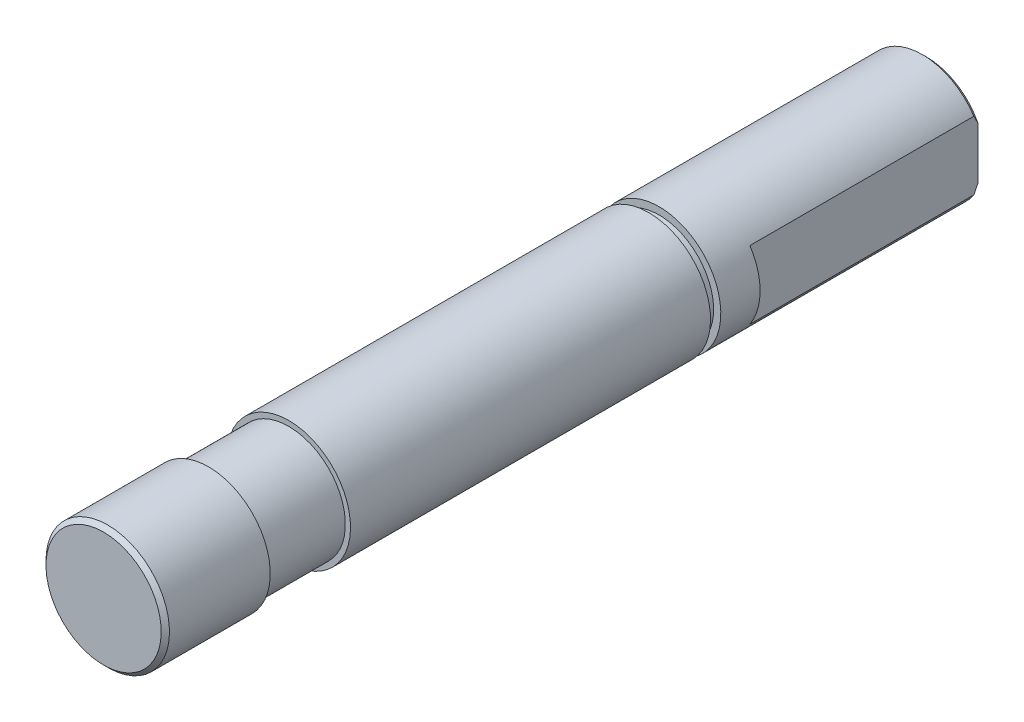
ISO-10303-21;
HEADER;
FILE_DESCRIPTION(('STEP AP214'),'2;1');
FILE_NAME('part.step','',(''),(''),'','','');
FILE_SCHEMA(('AUTOMOTIVE_DESIGN { 1 0 10303 214 1 1 1 1 }'));
ENDSEC;
DATA;
#1=APPLICATION_CONTEXT('core data for automotive mechanical design processes');
#2=APPLICATION_PROTOCOL_DEFINITION('international standard','automotive_design',2000,#1);
#3=PRODUCT_CONTEXT('',#1,'mechanical');
#4=PRODUCT('Part','Part','',(#3));
#5=PRODUCT_RELATED_PRODUCT_CATEGORY('part','',(#4));
#6=PRODUCT_DEFINITION_FORMATION('','',#4);
#7=PRODUCT_DEFINITION_CONTEXT('part definition',#1,'design');
#8=PRODUCT_DEFINITION('design','',#6,#7);
#9=PRODUCT_DEFINITION_SHAPE('','',#8);
#10=(LENGTH_UNIT() NAMED_UNIT(*) SI_UNIT(.MILLI.,.METRE.));
#11=(NAMED_UNIT(*) PLANE_ANGLE_UNIT() SI_UNIT($,.RADIAN.));
#12=(NAMED_UNIT(*) SI_UNIT($,.STERADIAN.) SOLID_ANGLE_UNIT());
#13=UNCERTAINTY_MEASURE_WITH_UNIT(LENGTH_MEASURE(1.E-05),#10,'distance_accuracy_value','');
#14=(GEOMETRIC_REPRESENTATION_CONTEXT(3) GLOBAL_UNCERTAINTY_ASSIGNED_CONTEXT((#13)) GLOBAL_UNIT_ASSIGNED_CONTEXT((#10,
#11,#12)) REPRESENTATION_CONTEXT('',''));
#15=CARTESIAN_POINT('',(0.,0.,0.));
#16=DIRECTION('',(0.,0.,1.));
#17=DIRECTION('',(1.,0.,0.));
#18=AXIS2_PLACEMENT_3D('',#15,#16,#17);
#19=CARTESIAN_POINT('',(-2.8336,-2.8336,40.));
#20=DIRECTION('',(0.,0.,1.));
#21=DIRECTION('',(1.,0.,0.));
#22=AXIS2_PLACEMENT_3D('',#19,#20,#21);
#23=PLANE('',#22);
#24=CARTESIAN_POINT('',(0.,0.,39.9999999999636));
#25=DIRECTION('',(0.,0.,-1.));
#26=DIRECTION('',(0.,1.,0.));
#27=AXIS2_PLACEMENT_3D('',#24,#25,#26);
#28=CIRCLE('',#27,2.79999999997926);
#29=CARTESIAN_POINT('',(0.,2.79999999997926,39.9999999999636));
#30=VERTEX_POINT('',#29);
#31=EDGE_CURVE('E20',#30,#30,#28,.T.);
#32=ORIENTED_EDGE('',*,*,#31,.F.);
#33=EDGE_LOOP('',(#32));
#34=FACE_BOUND('',#33,.T.);
#35=ADVANCED_FACE('F17',(#34),#23,.T.);
#36=CARTESIAN_POINT('',(-2.83180812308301,2.84325311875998,0.));
#37=DIRECTION('',(0.,0.,-1.));
#38=DIRECTION('',(-1.,0.,0.));
#39=AXIS2_PLACEMENT_3D('',#36,#37,#38);
#40=PLANE('',#39);
#41=CARTESIAN_POINT('',(0.,0.,0.));
#42=DIRECTION('',(0.,0.,1.));
#43=DIRECTION('',(1.,0.,0.));
#44=AXIS2_PLACEMENT_3D('',#41,#42,#43);
#45=CIRCLE('',#44,2.79999999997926);
#46=CARTESIAN_POINT('',(2.50135384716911,1.25826425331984,8.28163234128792E-12));
#47=VERTEX_POINT('',#46);
#48=CARTESIAN_POINT('',(2.50135384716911,-1.25826425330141,0.));
#49=VERTEX_POINT('',#48);
#50=EDGE_CURVE('E48',#47,#49,#45,.T.);
#51=ORIENTED_EDGE('',*,*,#50,.F.);
#52=DIRECTION('',(0.,1.,0.));
#53=VECTOR('',#52,1.);
#54=CARTESIAN_POINT('',(2.50135384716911,-1.6562695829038,0.));
#55=LINE('',#54,#53);
#56=EDGE_CURVE('E51',#49,#47,#55,.T.);
#57=ORIENTED_EDGE('',*,*,#56,.F.);
#58=EDGE_LOOP('',(#51,#57));
#59=FACE_BOUND('',#58,.T.);
#60=ADVANCED_FACE('F52',(#59),#40,.T.);
#61=CARTESIAN_POINT('',(0.,0.,39.8000000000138));
#62=DIRECTION('',(0.,0.,-1.));
#63=DIRECTION('',(0.,1.,0.));
#64=AXIS2_PLACEMENT_3D('',#61,#62,#63);
#65=CONICAL_SURFACE('',#64,2.99999999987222,0.785398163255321);
#66=ORIENTED_EDGE('',*,*,#31,.T.);
#67=EDGE_LOOP('',(#66));
#68=FACE_BOUND('',#67,.T.);
#69=CARTESIAN_POINT('',(0.,0.,39.8));
#70=DIRECTION('',(0.,0.,-1.));
#71=DIRECTION('',(-1.,0.,0.));
#72=AXIS2_PLACEMENT_3D('',#69,#70,#71);
#73=CIRCLE('',#72,3.);
#74=CARTESIAN_POINT('',(-3.,0.,39.8));
#75=VERTEX_POINT('',#74);
#76=EDGE_CURVE('E66',#75,#75,#73,.T.);
#77=ORIENTED_EDGE('',*,*,#76,.F.);
#78=EDGE_LOOP('',(#77));
#79=FACE_BOUND('',#78,.T.);
#80=ADVANCED_FACE('F91',(#68,#79),#65,.T.);
#81=CARTESIAN_POINT('',(0.,0.,0.200000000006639));
#82=DIRECTION('',(0.,0.,1.));
#83=DIRECTION('',(1.,0.,0.));
#84=AXIS2_PLACEMENT_3D('',#81,#82,#83);
#85=CONICAL_SURFACE('',#84,2.9999999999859,0.785398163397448);
#86=CARTESIAN_POINT('',(2.50135384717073,1.25826425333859,1.58616922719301E-11));
#87=CARTESIAN_POINT('',(2.5013538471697,1.29213988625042,0.0152238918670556));
#88=CARTESIAN_POINT('',(2.50135384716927,1.3258312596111,0.0308538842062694));
#89=CARTESIAN_POINT('',(2.50135384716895,1.39284470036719,0.0628516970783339));
#90=CARTESIAN_POINT('',(2.50135384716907,1.42616691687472,0.0792192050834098));
#91=CARTESIAN_POINT('',(2.50135384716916,1.4924681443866,0.112629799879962));
#92=CARTESIAN_POINT('',(2.50135384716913,1.52544717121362,0.129672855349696));
#93=CARTESIAN_POINT('',(2.50135384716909,1.59109264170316,0.16438386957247));
#94=CARTESIAN_POINT('',(2.50135384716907,1.62375894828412,0.182052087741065));
#95=CARTESIAN_POINT('',(2.50135384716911,1.6562695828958,0.200000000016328));
#96=B_SPLINE_CURVE_WITH_KNOTS('',3,(#86,#87,#88,#89,#90,#91,#92,#93,#94,#95),.UNSPECIFIED.,.F.,
.F.,(4,2,2,2,4),(0.,0.11141283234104,0.222778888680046,0.334139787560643,0.445547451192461),.UNSPECIFIED.);
#97=CARTESIAN_POINT('',(2.50135384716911,1.65626958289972,0.200000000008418));
#98=VERTEX_POINT('',#97);
#99=EDGE_CURVE('E56',#47,#98,#96,.T.);
#100=ORIENTED_EDGE('',*,*,#99,.F.);
#101=ORIENTED_EDGE('',*,*,#50,.T.);
#102=CARTESIAN_POINT('',(2.50135384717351,-1.65626958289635,0.200000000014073));
#103=CARTESIAN_POINT('',(2.5013538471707,-1.62375894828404,0.182052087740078));
#104=CARTESIAN_POINT('',(2.50135384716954,-1.59109264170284,0.164383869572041));
#105=CARTESIAN_POINT('',(2.50135384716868,-1.52544717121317,0.129672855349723));
#106=CARTESIAN_POINT('',(2.50135384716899,-1.49246814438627,0.112629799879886));
#107=CARTESIAN_POINT('',(2.50135384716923,-1.42616691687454,0.0792192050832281));
#108=CARTESIAN_POINT('',(2.50135384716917,-1.39284470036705,0.0628516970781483));
#109=CARTESIAN_POINT('',(2.50135384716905,-1.32583125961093,0.030853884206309));
#110=CARTESIAN_POINT('',(2.50135384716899,-1.29213988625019,0.0152238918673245));
#111=CARTESIAN_POINT('',(2.50135384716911,-1.25826425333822,1.65385804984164E-11));
#112=B_SPLINE_CURVE_WITH_KNOTS('',3,(#102,#103,#104,#105,#106,#107,#108,#109,#110,#111),
.UNSPECIFIED.,.F.,.F.,(4,2,2,2,4),(0.,0.111407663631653,0.2227685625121,0.334134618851,
0.445547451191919),.UNSPECIFIED.);
#113=CARTESIAN_POINT('',(2.50135384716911,-1.65626958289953,0.200000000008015));
#114=VERTEX_POINT('',#113);
#115=EDGE_CURVE('E60',#114,#49,#112,.T.);
#116=ORIENTED_EDGE('',*,*,#115,.F.);
#117=CARTESIAN_POINT('',(0.,0.,0.199999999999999));
#118=DIRECTION('',(0.,0.,1.));
#119=DIRECTION('',(0.,-1.,0.));
#120=AXIS2_PLACEMENT_3D('',#117,#118,#119);
#121=CIRCLE('',#120,3.);
#122=EDGE_CURVE('E69',#98,#114,#121,.T.);
#123=ORIENTED_EDGE('',*,*,#122,.F.);
#124=EDGE_LOOP('',(#100,#101,#116,#123));
#125=FACE_BOUND('',#124,.T.);
#126=ADVANCED_FACE('F59',(#125),#85,.T.);
#127=CARTESIAN_POINT('',(3.00299187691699,-1.67614481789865,11.0896717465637));
#128=DIRECTION('',(0.,0.,-1.));
#129=DIRECTION('',(-1.,0.,0.));
#130=AXIS2_PLACEMENT_3D('',#127,#128,#129);
#131=PLANE('',#130);
#132=CARTESIAN_POINT('',(0.,0.,11.0896717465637));
#133=DIRECTION('',(0.,0.,1.));
#134=DIRECTION('',(0.,-1.,0.));
#135=AXIS2_PLACEMENT_3D('',#132,#133,#134);
#136=CIRCLE('',#135,3.);
#137=CARTESIAN_POINT('',(2.50135384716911,-1.65626958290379,11.0896717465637));
#138=VERTEX_POINT('',#137);
#139=CARTESIAN_POINT('',(2.50135384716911,1.65626958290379,11.0896717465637));
#140=VERTEX_POINT('',#139);
#141=EDGE_CURVE('E79',#138,#140,#136,.T.);
#142=ORIENTED_EDGE('',*,*,#141,.F.);
#143=DIRECTION('',(0.,1.,0.));
#144=VECTOR('',#143,1.);
#145=CARTESIAN_POINT('',(2.50135384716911,-1.6562695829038,11.0896717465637));
#146=LINE('',#145,#144);
#147=EDGE_CURVE('E34',#140,#138,#146,.F.);
#148=ORIENTED_EDGE('',*,*,#147,.F.);
#149=EDGE_LOOP('',(#142,#148));
#150=FACE_BOUND('',#149,.T.);
#151=ADVANCED_FACE('F90',(#150),#131,.T.);
#152=CARTESIAN_POINT('',(2.50135384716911,-1.6562695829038,11.0896717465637));
#153=DIRECTION('',(1.,0.,0.));
#154=DIRECTION('',(0.,0.,-1.));
#155=AXIS2_PLACEMENT_3D('',#152,#153,#154);
#156=PLANE('',#155);
#157=DIRECTION('',(0.,0.,1.));
#158=VECTOR('',#157,1.);
#159=CARTESIAN_POINT('',(2.50135384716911,-1.65626958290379,13.));
#160=LINE('',#159,#158);
#161=EDGE_CURVE('E64',#114,#138,#160,.T.);
#162=ORIENTED_EDGE('',*,*,#161,.F.);
#163=ORIENTED_EDGE('',*,*,#115,.T.);
#164=ORIENTED_EDGE('',*,*,#56,.T.);
#165=ORIENTED_EDGE('',*,*,#99,.T.);
#166=DIRECTION('',(0.,0.,1.));
#167=VECTOR('',#166,1.);
#168=CARTESIAN_POINT('',(2.50135384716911,1.65626958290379,13.));
#169=LINE('',#168,#167);
#170=EDGE_CURVE('E148',#140,#98,#169,.F.);
#171=ORIENTED_EDGE('',*,*,#170,.F.);
#172=ORIENTED_EDGE('',*,*,#147,.T.);
#173=EDGE_LOOP('',(#162,#163,#164,#165,#171,#172));
#174=FACE_BOUND('',#173,.T.);
#175=ADVANCED_FACE('F62',(#174),#156,.T.);
#176=CARTESIAN_POINT('',(0.,0.,34.9));
#177=DIRECTION('',(0.,0.,-1.));
#178=DIRECTION('',(-1.,0.,0.));
#179=AXIS2_PLACEMENT_3D('',#176,#177,#178);
#180=CYLINDRICAL_SURFACE('',#179,3.);
#181=ORIENTED_EDGE('',*,*,#76,.T.);
#182=EDGE_LOOP('',(#181));
#183=FACE_BOUND('',#182,.T.);
#184=CARTESIAN_POINT('',(0.,0.,34.9));
#185=DIRECTION('',(0.,0.,-1.));
#186=DIRECTION('',(-1.,0.,0.));
#187=AXIS2_PLACEMENT_3D('',#184,#185,#186);
#188=CIRCLE('',#187,3.);
#189=CARTESIAN_POINT('',(-3.,0.,34.9));
#190=VERTEX_POINT('',#189);
#191=EDGE_CURVE('E146',#190,#190,#188,.T.);
#192=ORIENTED_EDGE('',*,*,#191,.F.);
#193=EDGE_LOOP('',(#192));
#194=FACE_BOUND('',#193,.T.);
#195=ADVANCED_FACE('F135',(#183,#194),#180,.T.);
#196=CARTESIAN_POINT('',(0.,0.,13.));
#197=DIRECTION('',(0.,0.,1.));
#198=DIRECTION('',(0.,-1.,0.));
#199=AXIS2_PLACEMENT_3D('',#196,#197,#198);
#200=CYLINDRICAL_SURFACE('',#199,3.);
#201=CARTESIAN_POINT('',(0.,0.,13.));
#202=DIRECTION('',(0.,0.,1.));
#203=DIRECTION('',(0.,-1.,0.));
#204=AXIS2_PLACEMENT_3D('',#201,#202,#203);
#205=CIRCLE('',#204,3.);
#206=CARTESIAN_POINT('',(0.,-3.,13.));
#207=VERTEX_POINT('',#206);
#208=EDGE_CURVE('E147',#207,#207,#205,.T.);
#209=ORIENTED_EDGE('',*,*,#208,.F.);
#210=EDGE_LOOP('',(#209));
#211=FACE_BOUND('',#210,.T.);
#212=ORIENTED_EDGE('',*,*,#141,.T.);
#213=ORIENTED_EDGE('',*,*,#170,.T.);
#214=ORIENTED_EDGE('',*,*,#122,.T.);
#215=ORIENTED_EDGE('',*,*,#161,.T.);
#216=EDGE_LOOP('',(#212,#213,#214,#215));
#217=FACE_BOUND('',#216,.T.);
#218=ADVANCED_FACE('F132',(#211,#217),#200,.T.);
#219=CARTESIAN_POINT('',(3.036,-3.03600212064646,34.9));
#220=DIRECTION('',(0.,0.,-1.));
#221=DIRECTION('',(-1.,0.,0.));
#222=AXIS2_PLACEMENT_3D('',#219,#220,#221);
#223=PLANE('',#222);
#224=ORIENTED_EDGE('',*,*,#191,.T.);
#225=EDGE_LOOP('',(#224));
#226=FACE_BOUND('',#225,.T.);
#227=CARTESIAN_POINT('',(0.,0.,34.9));
#228=DIRECTION('',(0.,0.,-1.));
#229=DIRECTION('',(-1.,0.,0.));
#230=AXIS2_PLACEMENT_3D('',#227,#228,#229);
#231=CIRCLE('',#230,2.75);
#232=CARTESIAN_POINT('',(-2.75,0.,34.9));
#233=VERTEX_POINT('',#232);
#234=EDGE_CURVE('E150',#233,#233,#231,.T.);
#235=ORIENTED_EDGE('',*,*,#234,.F.);
#236=EDGE_LOOP('',(#235));
#237=FACE_BOUND('',#236,.T.);
#238=ADVANCED_FACE('F128',(#226,#237),#223,.T.);
#239=CARTESIAN_POINT('',(3.036,3.03600212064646,13.));
#240=DIRECTION('',(0.,0.,1.));
#241=DIRECTION('',(1.,0.,0.));
#242=AXIS2_PLACEMENT_3D('',#239,#240,#241);
#243=PLANE('',#242);
#244=ORIENTED_EDGE('',*,*,#208,.T.);
#245=EDGE_LOOP('',(#244));
#246=FACE_BOUND('',#245,.T.);
#247=CARTESIAN_POINT('',(0.,0.,13.));
#248=DIRECTION('',(0.,0.,1.));
#249=DIRECTION('',(0.,-1.,0.));
#250=AXIS2_PLACEMENT_3D('',#247,#248,#249);
#251=CIRCLE('',#250,2.65);
#252=CARTESIAN_POINT('',(0.,-2.65,13.));
#253=VERTEX_POINT('',#252);
#254=EDGE_CURVE('E157',#253,#253,#251,.T.);
#255=ORIENTED_EDGE('',*,*,#254,.F.);
#256=EDGE_LOOP('',(#255));
#257=FACE_BOUND('',#256,.T.);
#258=ADVANCED_FACE('F124',(#246,#257),#243,.T.);
#259=CARTESIAN_POINT('',(0.,0.,31.));
#260=DIRECTION('',(0.,0.,-1.));
#261=DIRECTION('',(-1.,0.,0.));
#262=AXIS2_PLACEMENT_3D('',#259,#260,#261);
#263=CYLINDRICAL_SURFACE('',#262,2.75);
#264=ORIENTED_EDGE('',*,*,#234,.T.);
#265=EDGE_LOOP('',(#264));
#266=FACE_BOUND('',#265,.T.);
#267=CARTESIAN_POINT('',(0.,0.,31.));
#268=DIRECTION('',(0.,0.,-1.));
#269=DIRECTION('',(-1.,0.,0.));
#270=AXIS2_PLACEMENT_3D('',#267,#268,#269);
#271=CIRCLE('',#270,2.75);
#272=CARTESIAN_POINT('',(-2.75,0.,31.));
#273=VERTEX_POINT('',#272);
#274=EDGE_CURVE('E160',#273,#273,#271,.T.);
#275=ORIENTED_EDGE('',*,*,#274,.F.);
#276=EDGE_LOOP('',(#275));
#277=FACE_BOUND('',#276,.T.);
#278=ADVANCED_FACE('F120',(#266,#277),#263,.T.);
#279=CARTESIAN_POINT('',(0.,0.,13.5));
#280=DIRECTION('',(0.,0.,1.));
#281=DIRECTION('',(0.,-1.,0.));
#282=AXIS2_PLACEMENT_3D('',#279,#280,#281);
#283=CYLINDRICAL_SURFACE('',#282,2.65);
#284=CARTESIAN_POINT('',(0.,0.,13.5));
#285=DIRECTION('',(0.,0.,1.));
#286=DIRECTION('',(0.,-1.,0.));
#287=AXIS2_PLACEMENT_3D('',#284,#285,#286);
#288=CIRCLE('',#287,2.65);
#289=CARTESIAN_POINT('',(0.,-2.65,13.5));
#290=VERTEX_POINT('',#289);
#291=EDGE_CURVE('E163',#290,#290,#288,.T.);
#292=ORIENTED_EDGE('',*,*,#291,.F.);
#293=EDGE_LOOP('',(#292));
#294=FACE_BOUND('',#293,.T.);
#295=ORIENTED_EDGE('',*,*,#254,.T.);
#296=EDGE_LOOP('',(#295));
#297=FACE_BOUND('',#296,.T.);
#298=ADVANCED_FACE('F116',(#294,#297),#283,.T.);
#299=CARTESIAN_POINT('',(-3.036,-3.036,31.));
#300=DIRECTION('',(0.,0.,1.));
#301=DIRECTION('',(1.,0.,0.));
#302=AXIS2_PLACEMENT_3D('',#299,#300,#301);
#303=PLANE('',#302);
#304=CARTESIAN_POINT('',(0.,0.,31.));
#305=DIRECTION('',(0.,0.,-1.));
#306=DIRECTION('',(0.,1.,0.));
#307=AXIS2_PLACEMENT_3D('',#304,#305,#306);
#308=CIRCLE('',#307,3.);
#309=CARTESIAN_POINT('',(0.,3.00000000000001,31.));
#310=VERTEX_POINT('',#309);
#311=EDGE_CURVE('E26',#310,#310,#308,.T.);
#312=ORIENTED_EDGE('',*,*,#311,.F.);
#313=EDGE_LOOP('',(#312));
#314=FACE_BOUND('',#313,.T.);
#315=ORIENTED_EDGE('',*,*,#274,.T.);
#316=EDGE_LOOP('',(#315));
#317=FACE_BOUND('',#316,.T.);
#318=ADVANCED_FACE('F109',(#314,#317),#303,.T.);
#319=CARTESIAN_POINT('',(3.036,-3.03600212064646,13.5));
#320=DIRECTION('',(0.,0.,-1.));
#321=DIRECTION('',(-1.,0.,0.));
#322=AXIS2_PLACEMENT_3D('',#319,#320,#321);
#323=PLANE('',#322);
#324=CARTESIAN_POINT('',(0.,0.,13.5));
#325=DIRECTION('',(0.,0.,-1.));
#326=DIRECTION('',(0.,1.,0.));
#327=AXIS2_PLACEMENT_3D('',#324,#325,#326);
#328=CIRCLE('',#327,3.);
#329=CARTESIAN_POINT('',(0.,3.,13.5));
#330=VERTEX_POINT('',#329);
#331=EDGE_CURVE('E11',#330,#330,#328,.F.);
#332=ORIENTED_EDGE('',*,*,#331,.F.);
#333=EDGE_LOOP('',(#332));
#334=FACE_BOUND('',#333,.T.);
#335=ORIENTED_EDGE('',*,*,#291,.T.);
#336=EDGE_LOOP('',(#335));
#337=FACE_BOUND('',#336,.T.);
#338=ADVANCED_FACE('F103',(#334,#337),#323,.T.);
#339=CARTESIAN_POINT('',(0.,0.,13.5));
#340=DIRECTION('',(0.,0.,-1.));
#341=DIRECTION('',(0.,1.,0.));
#342=AXIS2_PLACEMENT_3D('',#339,#340,#341);
#343=CYLINDRICAL_SURFACE('',#342,3.);
#344=ORIENTED_EDGE('',*,*,#331,.T.);
#345=EDGE_LOOP('',(#344));
#346=FACE_BOUND('',#345,.T.);
#347=ORIENTED_EDGE('',*,*,#311,.T.);
#348=EDGE_LOOP('',(#347));
#349=FACE_BOUND('',#348,.T.);
#350=ADVANCED_FACE('F101',(#346,#349),#343,.T.);
#351=CLOSED_SHELL('',(#35,#60,#80,#126,#151,#175,#195,#218,#238,#258,#278,#298,#318,#338,#350));
#352=MANIFOLD_SOLID_BREP('B1',#351);
#353=ADVANCED_BREP_SHAPE_REPRESENTATION('',(#18,#352),#14);
#354=SHAPE_DEFINITION_REPRESENTATION(#9,#353);
ENDSEC;
END-ISO-10303-21;
